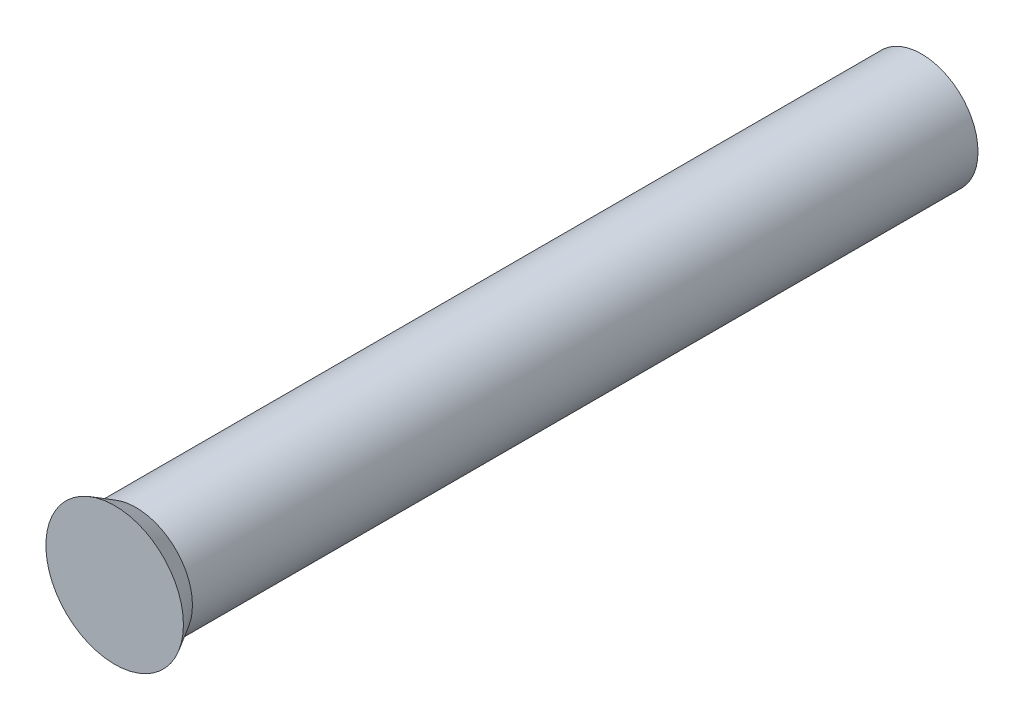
ISO-10303-21;
HEADER;
FILE_DESCRIPTION(('STEP AP214'),'2;1');
FILE_NAME('part.step','',(''),(''),'','','');
FILE_SCHEMA(('AUTOMOTIVE_DESIGN { 1 0 10303 214 1 1 1 1 }'));
ENDSEC;
DATA;
#1=APPLICATION_CONTEXT('core data for automotive mechanical design processes');
#2=APPLICATION_PROTOCOL_DEFINITION('international standard','automotive_design',2000,#1);
#3=PRODUCT_CONTEXT('',#1,'mechanical');
#4=PRODUCT('Part','Part','',(#3));
#5=PRODUCT_RELATED_PRODUCT_CATEGORY('part','',(#4));
#6=PRODUCT_DEFINITION_FORMATION('','',#4);
#7=PRODUCT_DEFINITION_CONTEXT('part definition',#1,'design');
#8=PRODUCT_DEFINITION('design','',#6,#7);
#9=PRODUCT_DEFINITION_SHAPE('','',#8);
#10=(LENGTH_UNIT() NAMED_UNIT(*) SI_UNIT(.MILLI.,.METRE.));
#11=(NAMED_UNIT(*) PLANE_ANGLE_UNIT() SI_UNIT($,.RADIAN.));
#12=(NAMED_UNIT(*) SI_UNIT($,.STERADIAN.) SOLID_ANGLE_UNIT());
#13=UNCERTAINTY_MEASURE_WITH_UNIT(LENGTH_MEASURE(1.E-05),#10,'distance_accuracy_value','');
#14=(GEOMETRIC_REPRESENTATION_CONTEXT(3) GLOBAL_UNCERTAINTY_ASSIGNED_CONTEXT((#13)) GLOBAL_UNIT_ASSIGNED_CONTEXT((#10,
#11,#12)) REPRESENTATION_CONTEXT('',''));
#15=CARTESIAN_POINT('',(0.,0.,0.));
#16=DIRECTION('',(0.,0.,1.));
#17=DIRECTION('',(1.,0.,0.));
#18=AXIS2_PLACEMENT_3D('',#15,#16,#17);
#19=CARTESIAN_POINT('',(0.,0.,19.812));
#20=DIRECTION('',(0.,0.,-1.));
#21=DIRECTION('',(-1.,0.,0.));
#22=AXIS2_PLACEMENT_3D('',#19,#20,#21);
#23=CYLINDRICAL_SURFACE('',#22,1.397);
#24=CARTESIAN_POINT('',(0.,0.,19.812));
#25=DIRECTION('',(0.,0.,1.));
#26=DIRECTION('',(1.,0.,0.));
#27=AXIS2_PLACEMENT_3D('',#24,#25,#26);
#28=CIRCLE('',#27,1.397);
#29=CARTESIAN_POINT('',(1.397,0.,19.812));
#30=VERTEX_POINT('',#29);
#31=EDGE_CURVE('E11',#30,#30,#28,.T.);
#32=ORIENTED_EDGE('',*,*,#31,.F.);
#33=EDGE_LOOP('',(#32));
#34=FACE_BOUND('',#33,.T.);
#35=CARTESIAN_POINT('',(0.,0.,0.374325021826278));
#36=DIRECTION('',(0.,0.,1.));
#37=DIRECTION('',(1.,0.,0.));
#38=AXIS2_PLACEMENT_3D('',#35,#36,#37);
#39=CIRCLE('',#38,1.397);
#40=CARTESIAN_POINT('',(1.397,0.,0.374325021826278));
#41=VERTEX_POINT('',#40);
#42=EDGE_CURVE('E39',#41,#41,#39,.T.);
#43=ORIENTED_EDGE('',*,*,#42,.T.);
#44=EDGE_LOOP('',(#43));
#45=FACE_BOUND('',#44,.T.);
#46=ADVANCED_FACE('F33',(#34,#45),#23,.T.);
#47=CARTESIAN_POINT('',(0.,0.,2.794));
#48=DIRECTION('',(0.,0.,1.));
#49=DIRECTION('',(0.,1.,0.));
#50=AXIS2_PLACEMENT_3D('',#47,#48,#49);
#51=SPHERICAL_SURFACE('',#50,2.794);
#52=CARTESIAN_POINT('',(0.,0.,0.));
#53=VERTEX_POINT('',#52);
#54=VERTEX_LOOP('',#53);
#55=FACE_BOUND('',#54,.T.);
#56=ORIENTED_EDGE('',*,*,#42,.F.);
#57=EDGE_LOOP('',(#56));
#58=FACE_BOUND('',#57,.T.);
#59=ADVANCED_FACE('F42',(#55,#58),#51,.T.);
#60=CARTESIAN_POINT('',(0.,1.70180000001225,20.3399290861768));
#61=DIRECTION('',(0.,0.,-1.));
#62=DIRECTION('',(-1.,0.,0.));
#63=AXIS2_PLACEMENT_3D('',#60,#61,#62);
#64=PLANE('',#63);
#65=CARTESIAN_POINT('',(0.,0.,20.339929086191));
#66=DIRECTION('',(0.,0.,1.));
#67=DIRECTION('',(1.,0.,0.));
#68=AXIS2_PLACEMENT_3D('',#65,#66,#67);
#69=CIRCLE('',#68,1.70180000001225);
#70=CARTESIAN_POINT('',(1.70180000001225,0.,20.339929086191));
#71=VERTEX_POINT('',#70);
#72=EDGE_CURVE('E49',#71,#71,#69,.T.);
#73=ORIENTED_EDGE('',*,*,#72,.T.);
#74=EDGE_LOOP('',(#73));
#75=FACE_BOUND('',#74,.T.);
#76=ADVANCED_FACE('F45',(#75),#64,.F.);
#77=CARTESIAN_POINT('',(0.,0.,19.812));
#78=DIRECTION('',(0.,0.,1.));
#79=DIRECTION('',(1.,0.,0.));
#80=AXIS2_PLACEMENT_3D('',#77,#78,#79);
#81=CONICAL_SURFACE('',#80,1.397,0.523598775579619);
#82=ORIENTED_EDGE('',*,*,#72,.F.);
#83=EDGE_LOOP('',(#82));
#84=FACE_BOUND('',#83,.T.);
#85=ORIENTED_EDGE('',*,*,#31,.T.);
#86=EDGE_LOOP('',(#85));
#87=FACE_BOUND('',#86,.T.);
#88=ADVANCED_FACE('F55',(#84,#87),#81,.T.);
#89=CLOSED_SHELL('',(#46,#59,#76,#88));
#90=MANIFOLD_SOLID_BREP('B2',#89);
#91=ADVANCED_BREP_SHAPE_REPRESENTATION('',(#18,#90),#14);
#92=SHAPE_DEFINITION_REPRESENTATION(#9,#91);
ENDSEC;
END-ISO-10303-21;
